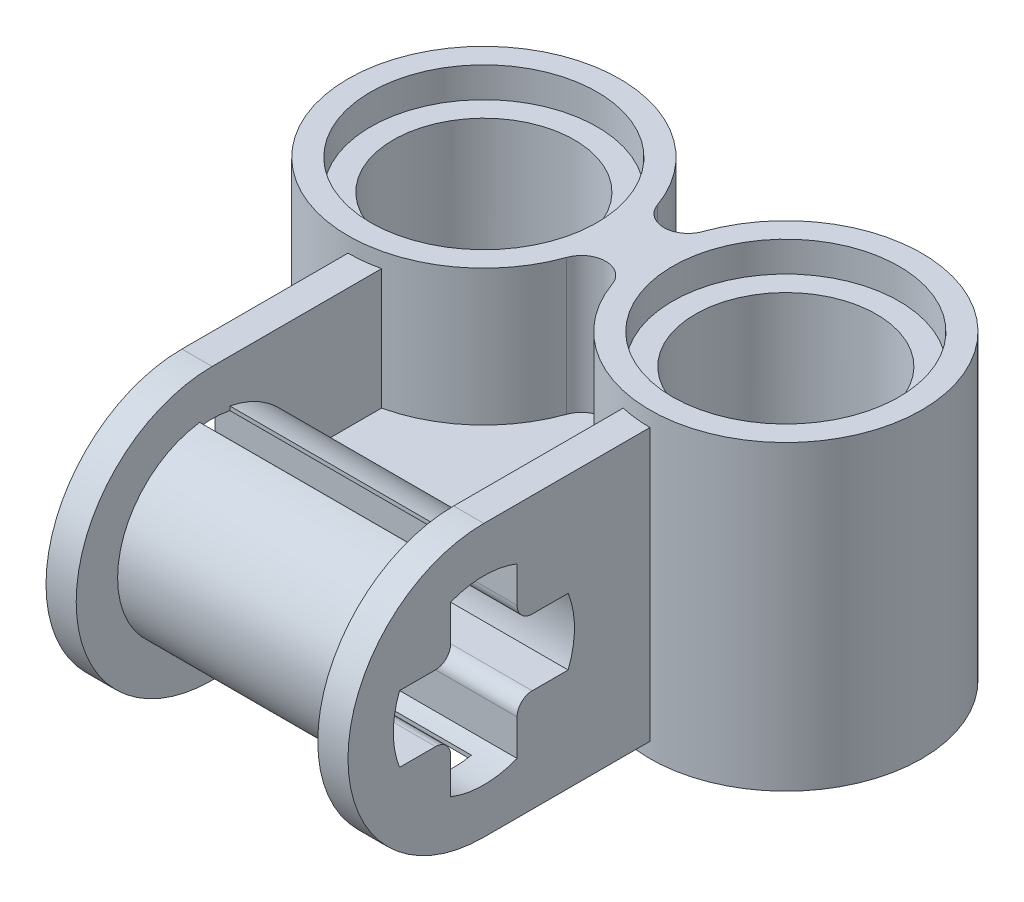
from build123d import *
from build123d.topology import SkipClean

# Parameters (mm, degrees)
BOSS_EXTRUDE1_DEPTH      = 4
BOSS_EXTRUDE1_DEPTH_BACK = 4
SKETCH1_R                = 2.4
CUT_EXTRUDE1_START       = -3.2
CUT_EXTRUDE1_DEPTH       = 3.2
SKETCH3_R                = 3
CUT_EXTRUDE2_DEPTH       = 0.8
BOSS_EXTRUDE2_DEPTH      = 8
BOSS_EXTRUDE2_2_DEPTH    = 8
BOSS_EXTRUDE4_DEPTH      = 3.6
BOSS_EXTRUDE5_START      = -3.6
BOSS_EXTRUDE5_DEPTH      = 3.6
CUT_EXTRUDE3_DEPTH       = 20.774731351
BOSS_EXTRUDE6_START      = -7.6
BOSS_EXTRUDE6_DEPTH      = 7.6
CUT_EXTRUDE4_REACH       = 21.535
SKETCH12_OUTSIDE_W       = 21.788
SKETCH12_OUTSIDE_H       = 21.788
CUT_EXTRUDE5_DEPTH       = 19.251575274
BOSS_EXTRUDE9_DEPTH      = 3.6
BOSS_EXTRUDE9_DEPTH_BACK = 3.6
CUT_EXTRUDE10_DEPTH      = 24.124013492
CUT_EXTRUDE11_DEPTH      = 24.124013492
CUT_EXTRUDE12_DEPTH      = 17.885496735
CUT_EXTRUDE13_DEPTH      = 3.2
CUT_EXTRUDE13_DEPTH_BACK = 3.2
CUT_EXTRUDE14_DEPTH      = 3.2
SKETCH25_W               = 6.4
SKETCH25_H               = 0.8
CUT_EXTRUDE15_DEPTH      = 19.079823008


with BuildPart() as part:
    # Sketch1 → Boss-Extrude1 (new, two sides: drawn at the far end of the back side and taken through both)
    with BuildSketch(Plane(origin=(0, 0, 0), x_dir=(1, 0, 0), z_dir=(0, 1, 0)).offset(-BOSS_EXTRUDE1_DEPTH_BACK)):
        with BuildLine():
            Line((0, 3.6), (8, 3.6))
            ThreePointArc((8, 3.6), (11.6, 0), (8, -3.6))
            Line((8, -3.6), (0, -3.6))
            ThreePointArc((0, -3.6), (-3.6, 0), (0, 3.6))
        make_face()
        with Locations(Location((0, 0, 0), (0, 0, 270))):
            Circle(SKETCH1_R, mode=Mode.SUBTRACT)
        with Locations(Location((8, 0, 0), (0, 0, 270))):
            Circle(SKETCH1_R, mode=Mode.SUBTRACT)
    extrude(amount=BOSS_EXTRUDE1_DEPTH + BOSS_EXTRUDE1_DEPTH_BACK)

    # Sketch2 → Cut-Extrude1 (cut)
    with SkipClean():  # the faces are left unmerged after this step: merging them gives an invalid solid
        with BuildSketch(Plane(origin=(0, 4, 0), x_dir=(1, 0, 0), z_dir=(0, 1, 0)).offset(CUT_EXTRUDE1_START)):
            with BuildLine():
                Line((0, 3.6), (8, 3.6))
                ThreePointArc((8, 3.6), (5.921539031, 2.939387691), (4.60588745, 1.2))
                ThreePointArc((4.60588745, 1.2), (4, 0.771572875), (3.39411255, 1.2))
                ThreePointArc((3.39411255, 1.2), (2.078460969, 2.939387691), (0, 3.6))
            make_face()
            with BuildLine():
                Line((8, -3.6), (0, -3.6))
                ThreePointArc((0, -3.6), (2.078460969, -2.939387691), (3.39411255, -1.2))
                ThreePointArc((3.39411255, -1.2), (4, -0.771572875), (4.60588745, -1.2))
                ThreePointArc((4.60588745, -1.2), (5.921539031, -2.939387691), (8, -3.6))
            make_face()
        cut_extrude1 = extrude(amount=CUT_EXTRUDE1_DEPTH, mode=Mode.SUBTRACT)

    # Mirror1: Cut-Extrude1 across plane
    with SkipClean():  # the faces are left unmerged after this step: merging them gives an invalid solid
        add(cut_extrude1.mirror(Plane.ZX), mode=Mode.SUBTRACT)

    # Sketch3 → Cut-Extrude2 (cut)
    with SkipClean():  # the faces are left unmerged after this step: merging them gives an invalid solid
        with BuildSketch(Plane(origin=(0, 4, 0), x_dir=(1, 0, 0), z_dir=(0, 1, 0))):
            with Locations(Location((0, 0, 0), (0, 0, 270))):
                Circle(SKETCH3_R)
            with Locations(Location((8, 0, 0), (0, 0, 270))):
                Circle(SKETCH3_R)
        cut_extrude2 = extrude(amount=-CUT_EXTRUDE2_DEPTH, mode=Mode.SUBTRACT)

    # Mirror2: Cut-Extrude2 across plane
    with SkipClean():  # the faces are left unmerged after this step: merging them gives an invalid solid
        add(cut_extrude2.mirror(Plane.ZX), mode=Mode.SUBTRACT)



with BuildPart() as body_2:
    # Sketch4 → Boss-Extrude2 (new body)
    with BuildSketch(Plane(origin=(0, 4, 0), x_dir=(1, 0, 0), z_dir=(0, 1, 0))):
        with BuildLine():
            Line((8, -3.6), (11.6, -3.6))
            Line((11.6, -3.6), (11.6, 0))
            ThreePointArc((11.6, 0), (10.545584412, -2.545584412), (8, -3.6))
        make_face()
    extrude(amount=-BOSS_EXTRUDE2_DEPTH)


with BuildPart() as body_3:
    # Sketch4 → Boss-Extrude2 2 (new body)
    with BuildSketch(Plane(origin=(0, 4, 0), x_dir=(1, 0, 0), z_dir=(0, 1, 0))):
        with BuildLine():
            Line((0, -3.6), (-3.6, -3.6))
            Line((-3.6, -3.6), (-3.6, 0))
            ThreePointArc((-3.6, 0), (-2.545584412, -2.545584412), (0, -3.6))
        make_face()
    extrude(amount=-BOSS_EXTRUDE2_2_DEPTH)


with BuildPart() as part_1:
    with SkipClean():  # the faces are left unmerged after this step: merging them gives an invalid solid
        add(part.part)

        add(body_2.part)  # Boss-Extrude4 merges body 2
        # Sketch5 → Boss-Extrude4 (add)
        with BuildSketch(Plane(origin=(11.6, 0, 0), x_dir=(0, 0, -1), z_dir=(1, 0, 0))):
            with BuildLine():
                Line((-3.6, 4), (-3.6, -4))
                Line((-3.6, -4), (-8, -4))
                ThreePointArc((-8, -4), (-12, 0), (-8, 4))
                Line((-8, 4), (-3.6, 4))
            make_face()
            with BuildLine():
                Line((-8.734516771, 2.284838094), (-8.734516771, 1.107318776))
                ThreePointArc((-8.734516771, 1.107318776), (-8.851674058, 0.824476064), (-9.134516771, 0.707318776))
                Line((-9.134516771, 0.707318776), (-10.293403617, 0.707318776))
                ThreePointArc((-10.293403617, 0.707318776), (-10.396518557, -0.129223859), (-10.204047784, -0.949828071))
                Line((-10.204047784, -0.949828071), (-9.134516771, -0.949828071))
                ThreePointArc((-9.134516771, -0.949828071), (-8.851674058, -1.066985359), (-8.734516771, -1.349828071))
                Line((-8.734516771, -1.349828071), (-8.734516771, -2.284838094))
                ThreePointArc((-8.734516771, -2.284838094), (-8.049479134, -2.399489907), (-7.360297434, -2.313175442))
                Line((-7.360297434, -2.313175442), (-7.360297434, -1.349828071))
                ThreePointArc((-7.360297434, -1.349828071), (-7.243140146, -1.066985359), (-6.960297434, -0.949828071))
                Line((-6.960297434, -0.949828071), (-5.795952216, -0.949828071))
                ThreePointArc((-5.795952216, -0.949828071), (-5.603481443, -0.129223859), (-5.706596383, 0.707318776))
                Line((-5.706596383, 0.707318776), (-6.960297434, 0.707318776))
                ThreePointArc((-6.960297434, 0.707318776), (-7.243140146, 0.824476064), (-7.360297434, 1.107318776))
                Line((-7.360297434, 1.107318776), (-7.360297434, 2.313175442))
                ThreePointArc((-7.360297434, 2.313175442), (-8.049479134, 2.399489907), (-8.734516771, 2.284838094))
            make_face(mode=Mode.SUBTRACT)
        extrude(amount=-BOSS_EXTRUDE4_DEPTH)


    with SkipClean():  # the faces are left unmerged after this step: merging them gives an invalid solid
        add(body_3.part)  # Boss-Extrude5 merges body 3
        # Sketch7 → Boss-Extrude5 (add)
        with BuildSketch(Plane.ZY.offset(3.6).offset(BOSS_EXTRUDE5_START)):
            with BuildLine():
                Line((3.6, 4), (3.6, -4))
                Line((3.6, -4), (8, -4))
                ThreePointArc((8, -4), (12, 0), (8, 4))
                Line((8, 4), (3.6, 4))
            make_face()
            with BuildLine():
                Line((7.360297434, 2.313175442), (7.360297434, 1.107318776))
                ThreePointArc((7.360297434, 1.107318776), (7.243140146, 0.824476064), (6.960297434, 0.707318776))
                Line((6.960297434, 0.707318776), (5.706596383, 0.707318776))
                ThreePointArc((5.706596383, 0.707318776), (5.603481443, -0.129223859), (5.795952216, -0.949828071))
                Line((5.795952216, -0.949828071), (6.960297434, -0.949828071))
                ThreePointArc((6.960297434, -0.949828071), (7.243140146, -1.066985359), (7.360297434, -1.349828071))
                Line((7.360297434, -1.349828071), (7.360297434, -2.313175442))
                ThreePointArc((7.360297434, -2.313175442), (8.049479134, -2.399489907), (8.734516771, -2.284838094))
                Line((8.734516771, -2.284838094), (8.734516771, -1.349828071))
                ThreePointArc((8.734516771, -1.349828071), (8.851674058, -1.066985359), (9.134516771, -0.949828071))
                Line((9.134516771, -0.949828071), (10.204047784, -0.949828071))
                ThreePointArc((10.204047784, -0.949828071), (10.396518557, -0.129223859), (10.293403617, 0.707318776))
                Line((10.293403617, 0.707318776), (9.134516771, 0.707318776))
                ThreePointArc((9.134516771, 0.707318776), (8.851674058, 0.824476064), (8.734516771, 1.107318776))
                Line((8.734516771, 1.107318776), (8.734516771, 2.284838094))
                ThreePointArc((8.734516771, 2.284838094), (8.049479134, 2.399489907), (7.360297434, 2.313175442))
            make_face(mode=Mode.SUBTRACT)
        extrude(amount=BOSS_EXTRUDE5_DEPTH)

    # Sketch8 → Cut-Extrude3 (cut, through all)
    with SkipClean():  # the faces are left unmerged after this step: merging them gives an invalid solid
        with BuildSketch(Plane.ZY.offset(3.6)):
            with BuildLine():
                Line((8, 3.6), (0, 3.6))
                Line((0, 3.6), (0, 4))
                Line((0, 4), (8, 4))
                ThreePointArc((8, 4), (12, 0), (8, -4))
                Line((8, -4), (0, -4))
                Line((0, -4), (0, -3.6))
                Line((0, -3.6), (8, -3.6))
                ThreePointArc((8, -3.6), (11.6, 0), (8, 3.6))
            make_face()
        extrude(amount=-CUT_EXTRUDE3_DEPTH, mode=Mode.SUBTRACT)

    # Sketch10 → Boss-Extrude6 (add)
    with SkipClean():  # the faces are left unmerged after this step: merging them gives an invalid solid
        with BuildSketch(Plane(origin=(0, 4, 0), x_dir=(1, 0, 0), z_dir=(0, 1, 0)).offset(BOSS_EXTRUDE6_START)):
            with BuildLine():
                Line((-3.6, 0), (-3, 0))
                ThreePointArc((-3, 0), (0, -3), (3, 0))
                Line((3, 0), (5, 0))
                ThreePointArc((5, 0), (8, -3), (11, 0))
                Line((11, 0), (11.6, 0))
                ThreePointArc((11.6, 0), (8.608767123, -3.548154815), (4.60588745, -1.2))
                ThreePointArc((4.60588745, -1.2), (4, -0.771572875), (3.39411255, -1.2))
                ThreePointArc((3.39411255, -1.2), (-0.608767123, -3.548154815), (-3.6, 0))
            make_face()
        boss_extrude6 = extrude(amount=BOSS_EXTRUDE6_DEPTH)

    # Mirror4: Boss-Extrude6 across plane
    with SkipClean():  # the faces are left unmerged after this step: merging them gives an invalid solid
        add(boss_extrude6.mirror(Plane.ZX))

    # Cut-Extrude4: up to this face of the body (flat: up to its plane)
    cut_extrude4_end = Plane(part_1.part.faces().sort_by_distance((11.6, 3.492371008, 5.8))[0])
    # Sketch11 → Cut-Extrude4 (cut, up to the picked face)
    with BuildSketch(Plane.ZY.offset(3.6), mode=Mode.PRIVATE) as cut_extrude4_sk1:
        with BuildLine():
            Line((5.706596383, 0.707318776), (4.863034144, 0.707318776))
            ThreePointArc((4.863034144, 0.707318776), (4.918518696, 0.966489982), (4.991044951, 1.221417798))
            ThreePointArc((4.991044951, 1.221417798), (4.933303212, 1.579295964), (4.610149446, 1.743559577))
            Line((4.610149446, 1.743559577), (4.189850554, 1.743559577))
            ThreePointArc((4.189850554, 1.743559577), (3.866696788, 1.579295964), (3.808955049, 1.221417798))
            ThreePointArc((3.808955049, 1.221417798), (4, 0), (3.808955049, -1.221417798))
            ThreePointArc((3.808955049, -1.221417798), (3.866696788, -1.579295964), (4.189850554, -1.743559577))
            Line((4.189850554, -1.743559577), (4.610149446, -1.743559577))
            ThreePointArc((4.610149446, -1.743559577), (4.933303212, -1.579295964), (4.991044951, -1.221417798))
            ThreePointArc((4.991044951, -1.221417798), (4.950330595, -1.086298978), (4.914407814, -0.949828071))
            Line((4.914407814, -0.949828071), (5.795952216, -0.949828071))
            ThreePointArc((5.795952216, -0.949828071), (5.603481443, -0.129223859), (5.706596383, 0.707318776))
        make_face()
    cut_extrude4_tool1 = split(extrude(cut_extrude4_sk1.sketch, amount=-CUT_EXTRUDE4_REACH, mode=Mode.PRIVATE), bisect_by=cut_extrude4_end, keep=Keep.BOTH, mode=Mode.PRIVATE)
    add(cut_extrude4_tool1.solids().sort_by(Axis((-3.6, -0.036424, 4.640938), (1, 0, 0)))[0], mode=Mode.SUBTRACT)

    # Sketch12 outside → Cut-Extrude5 (cut, through all)
    with SkipClean():  # the faces are left unmerged after this step: merging them gives an invalid solid
        with BuildSketch(Plane(origin=(0, 4, 0), x_dir=(1, 0, 0), z_dir=(0, 1, 0))):
            with Locations((4, -4)):
                Rectangle(SKETCH12_OUTSIDE_W, SKETCH12_OUTSIDE_H)
            with BuildLine():
                Line((0, 3.6), (8, 3.6))
                ThreePointArc((8, 3.6), (11.6, 0), (8, -3.6))
                Line((8, -3.6), (0, -3.6))
                ThreePointArc((0, -3.6), (-3.6, 0), (0, 3.6))
            make_face(mode=Mode.SUBTRACT)
        extrude(amount=-CUT_EXTRUDE5_DEPTH, mode=Mode.SUBTRACT)

    # Sketch19 → Boss-Extrude9 (add, two sides: drawn at the far end of the back side and taken through both)
    with SkipClean():  # the faces are left unmerged after this step: merging them gives an invalid solid
        with BuildSketch(Plane(origin=(0, 0, 0), x_dir=(1, 0, 0), z_dir=(0, 1, 0)).offset(-BOSS_EXTRUDE9_DEPTH_BACK)):
            with BuildLine():
                Line((0, -3.6), (0, -15.2))
                Line((0, -15.2), (0, -18.8))
                Line((0, -18.8), (0, -19.6))
                Line((0, -19.6), (4, -19.6))
                Line((4, -19.6), (8, -19.6))
                Line((8, -19.6), (8, -18.8))
                Line((8, -18.8), (8, -15.2))
                Line((8, -15.2), (8, -3.6))
                ThreePointArc((8, -3.6), (6.62337951, -3.326396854), (5.456007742, -2.547175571))
                Line((5.456007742, -2.547175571), (2.543992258, -2.547175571))
                ThreePointArc((2.543992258, -2.547175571), (1.37662049, -3.326396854), (0, -3.6))
            make_face()
        extrude(amount=BOSS_EXTRUDE9_DEPTH + BOSS_EXTRUDE9_DEPTH_BACK)

    # Sketch20 → Cut-Extrude10 (cut, through all)
    with SkipClean():  # the faces are left unmerged after this step: merging them gives an invalid solid
        with BuildSketch(Plane.ZY):
            with BuildLine():
                Line((16, 3.6), (20.66185431, 3.6))
                Line((20.66185431, 3.6), (20.66185431, -3.6))
                Line((20.66185431, -3.6), (16, -3.6))
                ThreePointArc((16, -3.6), (19.6, 0), (16, 3.6))
            make_face()
        extrude(amount=-CUT_EXTRUDE10_DEPTH, mode=Mode.SUBTRACT)

    # Sketch21 → Cut-Extrude11 (cut, through all)
    with SkipClean():  # the faces are left unmerged after this step: merging them gives an invalid solid
        with BuildSketch(Plane(origin=(8, 0, 0), x_dir=(0, 0, -1), z_dir=(1, 0, 0))):
            with BuildLine():
                Line((-8, 3.6), (-8, 4.532955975))
                Line((-8, 4.532955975), (-20.697355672, 4.532955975))
                Line((-20.697355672, 4.532955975), (-20.697355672, -4.355192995))
                Line((-20.697355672, -4.355192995), (-8, -4.355192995))
                Line((-8, -4.355192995), (-8, -3.6))
                ThreePointArc((-8, -3.6), (-11.6, 0), (-8, 3.6))
            make_face()
        extrude(amount=-CUT_EXTRUDE11_DEPTH, mode=Mode.SUBTRACT)

    # Sketch22 → Cut-Extrude12 (cut, through all)
    with SkipClean():  # the faces are left unmerged after this step: merging them gives an invalid solid
        with BuildSketch(Plane(origin=(8, 0, 0), x_dir=(0, 0, -1), z_dir=(1, 0, 0))):
            with BuildLine():
                Line((-8.88, 2.232845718), (-8.88, 1.28))
                ThreePointArc((-8.88, 1.28), (-8.997157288, 0.997157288), (-9.28, 0.88))
                Line((-9.28, 0.88), (-10.232845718, 0.88))
                ThreePointArc((-10.232845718, 0.88), (-10.4, 0), (-10.232845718, -0.88))
                Line((-10.232845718, -0.88), (-9.28, -0.88))
                ThreePointArc((-9.28, -0.88), (-8.997157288, -0.997157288), (-8.88, -1.28))
                Line((-8.88, -1.28), (-8.88, -2.232845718))
                ThreePointArc((-8.88, -2.232845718), (-8, -2.4), (-7.12, -2.232845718))
                Line((-7.12, -2.232845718), (-7.12, -1.28))
                ThreePointArc((-7.12, -1.28), (-7.002842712, -0.997157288), (-6.72, -0.88))
                Line((-6.72, -0.88), (-5.767154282, -0.88))
                ThreePointArc((-5.767154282, -0.88), (-5.6, 0), (-5.767154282, 0.88))
                Line((-5.767154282, 0.88), (-6.72, 0.88))
                ThreePointArc((-6.72, 0.88), (-7.002842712, 0.997157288), (-7.12, 1.28))
                Line((-7.12, 1.28), (-7.12, 2.232845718))
                ThreePointArc((-7.12, 2.232845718), (-8, 2.4), (-8.88, 2.232845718))
            make_face()
        extrude(amount=-CUT_EXTRUDE12_DEPTH, mode=Mode.SUBTRACT)

    # Sketch23 → Cut-Extrude13 (cut, two sides: drawn at the far end of the back side and taken through both)
    with SkipClean():  # the faces are left unmerged after this step: merging them gives an invalid solid
        with BuildSketch(Plane(origin=(4, 0, 0), x_dir=(0, 0, -1), z_dir=(1, 0, 0)).offset(-CUT_EXTRUDE13_DEPTH_BACK)):
            with BuildLine():
                Line((-8, 3.743051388), (-4.256948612, 3.743051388))
                Line((-4.256948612, 3.743051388), (-4.256948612, 0.4))
                Line((-4.256948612, 0.4), (-5.52902967, 0.4))
                ThreePointArc((-5.52902967, 0.4), (-10.503136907, 0), (-5.52902967, -0.4))
                Line((-5.52902967, -0.4), (-4.256948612, -0.4))
                Line((-4.256948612, -0.4), (-4.256948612, -3.743051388))
                Line((-4.256948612, -3.743051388), (-8, -3.743051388))
                ThreePointArc((-8, -3.743051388), (-11.743051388, 0), (-8, 3.743051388))
            make_face()
        extrude(amount=CUT_EXTRUDE13_DEPTH + CUT_EXTRUDE13_DEPTH_BACK, mode=Mode.SUBTRACT)

    # Sketch24 → Cut-Extrude14 (cut)
    with SkipClean():  # the faces are left unmerged after this step: merging them gives an invalid solid
        with BuildSketch(Plane(origin=(0, 3.6, 0), x_dir=(1, 0, 0), z_dir=(0, 1, 0))):
            with BuildLine():
                Line((0.8, -4.256948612), (0.8, -3.509985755))
                ThreePointArc((0.8, -3.509985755), (2.39408721, -2.68855843), (3.39411255, -1.2))
                ThreePointArc((3.39411255, -1.2), (4, -0.771572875), (4.60588745, -1.2))
                ThreePointArc((4.60588745, -1.2), (5.60591279, -2.68855843), (7.2, -3.509985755))
                Line((7.2, -3.509985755), (7.2, -4.256948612))
                Line((7.2, -4.256948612), (0.8, -4.256948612))
            make_face()
        cut_extrude14 = extrude(amount=-CUT_EXTRUDE14_DEPTH, mode=Mode.SUBTRACT)

    # Mirror5: Cut-Extrude14 across plane
    with SkipClean():  # the faces are left unmerged after this step: merging them gives an invalid solid
        add(cut_extrude14.mirror(Plane.ZX), mode=Mode.SUBTRACT)

    # Sketch25 → Cut-Extrude15 (cut, through all)
    with SkipClean():  # the faces are left unmerged after this step: merging them gives an invalid solid
        with BuildSketch(Plane(origin=(0, 3.6, 0), x_dir=(1, 0, 0), z_dir=(0, 1, 0))):
            with Locations((4, -7.92902967)):
                Rectangle(SKETCH25_W, SKETCH25_H)
        extrude(amount=-CUT_EXTRUDE15_DEPTH, mode=Mode.SUBTRACT)


solid = part_1.part
